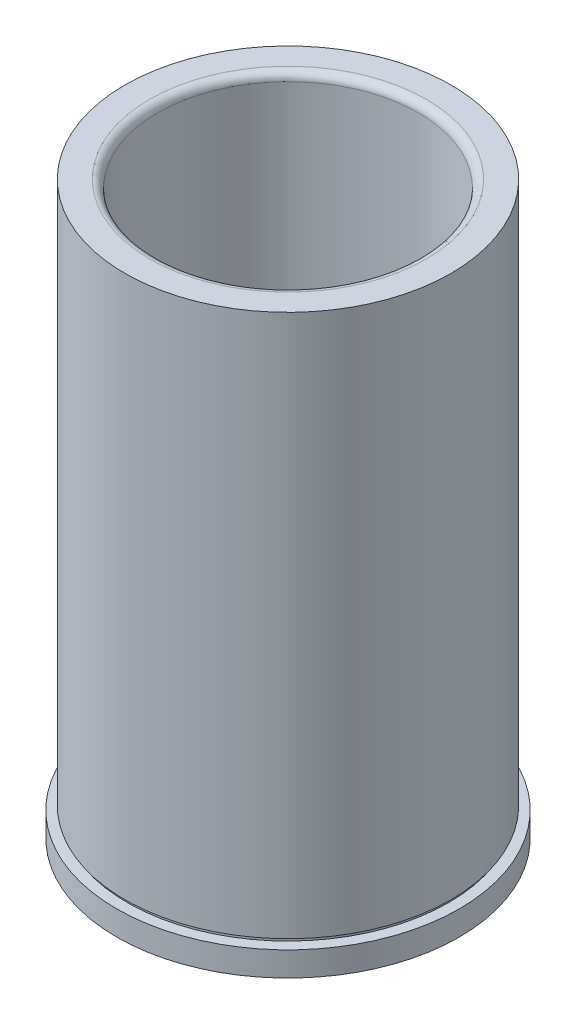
ISO-10303-21;
HEADER;
FILE_DESCRIPTION(('STEP AP214'),'2;1');
FILE_NAME('part.step','',(''),(''),'','','');
FILE_SCHEMA(('AUTOMOTIVE_DESIGN { 1 0 10303 214 1 1 1 1 }'));
ENDSEC;
DATA;
#1=APPLICATION_CONTEXT('core data for automotive mechanical design processes');
#2=APPLICATION_PROTOCOL_DEFINITION('international standard','automotive_design',2000,#1);
#3=PRODUCT_CONTEXT('',#1,'mechanical');
#4=PRODUCT('Part','Part','',(#3));
#5=PRODUCT_RELATED_PRODUCT_CATEGORY('part','',(#4));
#6=PRODUCT_DEFINITION_FORMATION('','',#4);
#7=PRODUCT_DEFINITION_CONTEXT('part definition',#1,'design');
#8=PRODUCT_DEFINITION('design','',#6,#7);
#9=PRODUCT_DEFINITION_SHAPE('','',#8);
#10=(LENGTH_UNIT() NAMED_UNIT(*) SI_UNIT(.MILLI.,.METRE.));
#11=(NAMED_UNIT(*) PLANE_ANGLE_UNIT() SI_UNIT($,.RADIAN.));
#12=(NAMED_UNIT(*) SI_UNIT($,.STERADIAN.) SOLID_ANGLE_UNIT());
#13=UNCERTAINTY_MEASURE_WITH_UNIT(LENGTH_MEASURE(1.E-05),#10,'distance_accuracy_value','');
#14=(GEOMETRIC_REPRESENTATION_CONTEXT(3) GLOBAL_UNCERTAINTY_ASSIGNED_CONTEXT((#13)) GLOBAL_UNIT_ASSIGNED_CONTEXT((#10,
#11,#12)) REPRESENTATION_CONTEXT('',''));
#15=CARTESIAN_POINT('',(0.,0.,0.));
#16=DIRECTION('',(0.,0.,1.));
#17=DIRECTION('',(1.,0.,0.));
#18=AXIS2_PLACEMENT_3D('',#15,#16,#17);
#19=CARTESIAN_POINT('',(-31.75635,111.125,0.));
#20=DIRECTION('',(0.,-1.,0.));
#21=DIRECTION('',(1.,0.,0.));
#22=AXIS2_PLACEMENT_3D('',#19,#20,#21);
#23=PLANE('',#22);
#24=CARTESIAN_POINT('',(-3.8799108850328E-13,111.125,0.));
#25=DIRECTION('',(0.,-1.,0.));
#26=DIRECTION('',(1.,0.,0.));
#27=AXIS2_PLACEMENT_3D('',#24,#25,#26);
#28=CIRCLE('',#27,26.9303499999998);
#29=CARTESIAN_POINT('',(26.9303499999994,111.125,0.));
#30=VERTEX_POINT('',#29);
#31=EDGE_CURVE('E36',#30,#30,#28,.T.);
#32=ORIENTED_EDGE('',*,*,#31,.T.);
#33=EDGE_LOOP('',(#32));
#34=FACE_BOUND('',#33,.T.);
#35=CARTESIAN_POINT('',(-3.8799108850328E-13,111.125,0.));
#36=DIRECTION('',(0.,-1.,0.));
#37=DIRECTION('',(1.,0.,0.));
#38=AXIS2_PLACEMENT_3D('',#35,#36,#37);
#39=CIRCLE('',#38,31.7563499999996);
#40=CARTESIAN_POINT('',(31.7563499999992,111.125,0.));
#41=VERTEX_POINT('',#40);
#42=EDGE_CURVE('E40',#41,#41,#39,.T.);
#43=ORIENTED_EDGE('',*,*,#42,.F.);
#44=EDGE_LOOP('',(#43));
#45=FACE_BOUND('',#44,.T.);
#46=ADVANCED_FACE('F29',(#34,#45),#23,.F.);
#47=CARTESIAN_POINT('',(3.49148336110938E-12,-1000.,0.));
#48=DIRECTION('',(0.,-1.,0.));
#49=DIRECTION('',(1.,0.,0.));
#50=AXIS2_PLACEMENT_3D('',#47,#48,#49);
#51=CYLINDRICAL_SURFACE('',#50,31.7563499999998);
#52=CARTESIAN_POINT('',(0.,5.52449999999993,0.));
#53=DIRECTION('',(0.,-1.,0.));
#54=DIRECTION('',(1.,0.,0.));
#55=AXIS2_PLACEMENT_3D('',#52,#53,#54);
#56=CIRCLE('',#55,31.75635);
#57=CARTESIAN_POINT('',(31.7563499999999,5.52450000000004,0.));
#58=VERTEX_POINT('',#57);
#59=EDGE_CURVE('E44',#58,#58,#56,.T.);
#60=ORIENTED_EDGE('',*,*,#59,.F.);
#61=EDGE_LOOP('',(#60));
#62=FACE_BOUND('',#61,.T.);
#63=ORIENTED_EDGE('',*,*,#42,.T.);
#64=EDGE_LOOP('',(#63));
#65=FACE_BOUND('',#64,.T.);
#66=ADVANCED_FACE('F121',(#62,#65),#51,.T.);
#67=CARTESIAN_POINT('',(-31.75635,5.52449999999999,0.));
#68=DIRECTION('',(0.,1.,0.));
#69=DIRECTION('',(-1.,0.,0.));
#70=AXIS2_PLACEMENT_3D('',#67,#68,#69);
#71=PLANE('',#70);
#72=CARTESIAN_POINT('',(0.,5.52449999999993,0.));
#73=DIRECTION('',(0.,-1.,0.));
#74=DIRECTION('',(1.,0.,0.));
#75=AXIS2_PLACEMENT_3D('',#72,#73,#74);
#76=CIRCLE('',#75,31.24835);
#77=CARTESIAN_POINT('',(31.2483499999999,5.52450000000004,0.));
#78=VERTEX_POINT('',#77);
#79=EDGE_CURVE('E49',#78,#78,#76,.T.);
#80=ORIENTED_EDGE('',*,*,#79,.F.);
#81=EDGE_LOOP('',(#80));
#82=FACE_BOUND('',#81,.T.);
#83=ORIENTED_EDGE('',*,*,#59,.T.);
#84=EDGE_LOOP('',(#83));
#85=FACE_BOUND('',#84,.T.);
#86=ADVANCED_FACE('F115',(#82,#85),#71,.F.);
#87=CARTESIAN_POINT('',(3.49148336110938E-12,-1000.,0.));
#88=DIRECTION('',(0.,-1.,0.));
#89=DIRECTION('',(1.,0.,0.));
#90=AXIS2_PLACEMENT_3D('',#87,#88,#89);
#91=CYLINDRICAL_SURFACE('',#90,31.24835);
#92=CARTESIAN_POINT('',(0.,4.7625,0.));
#93=DIRECTION('',(0.,-1.,0.));
#94=DIRECTION('',(1.,0.,0.));
#95=AXIS2_PLACEMENT_3D('',#92,#93,#94);
#96=CIRCLE('',#95,31.24835);
#97=CARTESIAN_POINT('',(31.24835,4.76250000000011,0.));
#98=VERTEX_POINT('',#97);
#99=EDGE_CURVE('E52',#98,#98,#96,.T.);
#100=ORIENTED_EDGE('',*,*,#99,.F.);
#101=EDGE_LOOP('',(#100));
#102=FACE_BOUND('',#101,.T.);
#103=ORIENTED_EDGE('',*,*,#79,.T.);
#104=EDGE_LOOP('',(#103));
#105=FACE_BOUND('',#104,.T.);
#106=ADVANCED_FACE('F109',(#102,#105),#91,.T.);
#107=CARTESIAN_POINT('',(-33.3375,4.76249999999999,0.));
#108=DIRECTION('',(0.,-1.,0.));
#109=DIRECTION('',(1.,0.,0.));
#110=AXIS2_PLACEMENT_3D('',#107,#108,#109);
#111=PLANE('',#110);
#112=CARTESIAN_POINT('',(0.,4.76250000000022,0.));
#113=DIRECTION('',(0.,-1.,0.));
#114=DIRECTION('',(1.,0.,0.));
#115=AXIS2_PLACEMENT_3D('',#112,#113,#114);
#116=CIRCLE('',#115,33.3375);
#117=CARTESIAN_POINT('',(33.3375,4.76250000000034,0.));
#118=VERTEX_POINT('',#117);
#119=EDGE_CURVE('E55',#118,#118,#116,.T.);
#120=ORIENTED_EDGE('',*,*,#119,.F.);
#121=EDGE_LOOP('',(#120));
#122=FACE_BOUND('',#121,.T.);
#123=ORIENTED_EDGE('',*,*,#99,.T.);
#124=EDGE_LOOP('',(#123));
#125=FACE_BOUND('',#124,.T.);
#126=ADVANCED_FACE('F103',(#122,#125),#111,.F.);
#127=CARTESIAN_POINT('',(3.49148336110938E-12,-1000.,0.));
#128=DIRECTION('',(0.,-1.,0.));
#129=DIRECTION('',(1.,0.,0.));
#130=AXIS2_PLACEMENT_3D('',#127,#128,#129);
#131=CYLINDRICAL_SURFACE('',#130,33.3375);
#132=CARTESIAN_POINT('',(0.,2.22044604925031E-13,0.));
#133=DIRECTION('',(0.,-1.,0.));
#134=DIRECTION('',(1.,0.,0.));
#135=AXIS2_PLACEMENT_3D('',#132,#133,#134);
#136=CIRCLE('',#135,33.3375);
#137=CARTESIAN_POINT('',(33.3375,3.38441931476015E-13,0.));
#138=VERTEX_POINT('',#137);
#139=EDGE_CURVE('E58',#138,#138,#136,.T.);
#140=ORIENTED_EDGE('',*,*,#139,.F.);
#141=EDGE_LOOP('',(#140));
#142=FACE_BOUND('',#141,.T.);
#143=ORIENTED_EDGE('',*,*,#119,.T.);
#144=EDGE_LOOP('',(#143));
#145=FACE_BOUND('',#144,.T.);
#146=ADVANCED_FACE('F97',(#142,#145),#131,.T.);
#147=CARTESIAN_POINT('',(-27.4701,0.,0.));
#148=DIRECTION('',(0.,1.,0.));
#149=DIRECTION('',(-1.,0.,0.));
#150=AXIS2_PLACEMENT_3D('',#147,#148,#149);
#151=PLANE('',#150);
#152=CARTESIAN_POINT('',(0.,0.,0.));
#153=DIRECTION('',(0.,-1.,0.));
#154=DIRECTION('',(1.,0.,0.));
#155=AXIS2_PLACEMENT_3D('',#152,#153,#154);
#156=CIRCLE('',#155,27.4701);
#157=CARTESIAN_POINT('',(27.4701,0.,0.));
#158=VERTEX_POINT('',#157);
#159=EDGE_CURVE('E61',#158,#158,#156,.T.);
#160=ORIENTED_EDGE('',*,*,#159,.F.);
#161=EDGE_LOOP('',(#160));
#162=FACE_BOUND('',#161,.T.);
#163=ORIENTED_EDGE('',*,*,#139,.T.);
#164=EDGE_LOOP('',(#163));
#165=FACE_BOUND('',#164,.T.);
#166=ADVANCED_FACE('F91',(#162,#165),#151,.F.);
#167=CARTESIAN_POINT('',(0.,0.,0.));
#168=DIRECTION('',(0.,-1.,0.));
#169=DIRECTION('',(1.,0.,0.));
#170=AXIS2_PLACEMENT_3D('',#167,#168,#169);
#171=CONICAL_SURFACE('',#170,27.4701,0.785398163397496);
#172=CARTESIAN_POINT('',(0.,0.793749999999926,0.));
#173=DIRECTION('',(0.,-1.,0.));
#174=DIRECTION('',(1.,0.,0.));
#175=AXIS2_PLACEMENT_3D('',#172,#173,#174);
#176=CIRCLE('',#175,26.67635);
#177=CARTESIAN_POINT('',(26.67635,0.79375000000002,0.));
#178=VERTEX_POINT('',#177);
#179=EDGE_CURVE('E64',#178,#178,#176,.T.);
#180=ORIENTED_EDGE('',*,*,#179,.F.);
#181=EDGE_LOOP('',(#180));
#182=FACE_BOUND('',#181,.T.);
#183=ORIENTED_EDGE('',*,*,#159,.T.);
#184=EDGE_LOOP('',(#183));
#185=FACE_BOUND('',#184,.T.);
#186=ADVANCED_FACE('F85',(#182,#185),#171,.F.);
#187=CARTESIAN_POINT('',(3.49148336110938E-12,-1000.,0.));
#188=DIRECTION('',(0.,-1.,0.));
#189=DIRECTION('',(1.,0.,0.));
#190=AXIS2_PLACEMENT_3D('',#187,#188,#189);
#191=CYLINDRICAL_SURFACE('',#190,26.67635);
#192=CARTESIAN_POINT('',(0.,8.2549999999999,0.));
#193=DIRECTION('',(0.,-1.,0.));
#194=DIRECTION('',(1.,0.,0.));
#195=AXIS2_PLACEMENT_3D('',#192,#193,#194);
#196=CIRCLE('',#195,26.67635);
#197=CARTESIAN_POINT('',(26.6763499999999,8.255,0.));
#198=VERTEX_POINT('',#197);
#199=EDGE_CURVE('E67',#198,#198,#196,.T.);
#200=ORIENTED_EDGE('',*,*,#199,.F.);
#201=EDGE_LOOP('',(#200));
#202=FACE_BOUND('',#201,.T.);
#203=ORIENTED_EDGE('',*,*,#179,.T.);
#204=EDGE_LOOP('',(#203));
#205=FACE_BOUND('',#204,.T.);
#206=ADVANCED_FACE('F79',(#202,#205),#191,.F.);
#207=CARTESIAN_POINT('',(0.,8.255,0.));
#208=DIRECTION('',(0.,-1.,0.));
#209=DIRECTION('',(1.,0.,0.));
#210=AXIS2_PLACEMENT_3D('',#207,#208,#209);
#211=TOROIDAL_SURFACE('',#210,25.40635,1.27);
#212=CARTESIAN_POINT('',(0.,9.52500000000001,0.));
#213=DIRECTION('',(0.,-1.,0.));
#214=DIRECTION('',(1.,0.,0.));
#215=AXIS2_PLACEMENT_3D('',#212,#213,#214);
#216=CIRCLE('',#215,25.40635);
#217=CARTESIAN_POINT('',(25.4063499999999,9.52500000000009,0.));
#218=VERTEX_POINT('',#217);
#219=EDGE_CURVE('E70',#218,#218,#216,.T.);
#220=ORIENTED_EDGE('',*,*,#219,.F.);
#221=EDGE_LOOP('',(#220));
#222=FACE_BOUND('',#221,.T.);
#223=ORIENTED_EDGE('',*,*,#199,.T.);
#224=EDGE_LOOP('',(#223));
#225=FACE_BOUND('',#224,.T.);
#226=ADVANCED_FACE('F76',(#222,#225),#211,.F.);
#227=CARTESIAN_POINT('',(3.49148336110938E-12,-1000.,0.));
#228=DIRECTION('',(0.,-1.,0.));
#229=DIRECTION('',(1.,0.,0.));
#230=AXIS2_PLACEMENT_3D('',#227,#228,#229);
#231=CYLINDRICAL_SURFACE('',#230,25.4063499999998);
#232=CARTESIAN_POINT('',(-3.8267006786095E-13,109.601,0.));
#233=DIRECTION('',(0.,-1.,0.));
#234=DIRECTION('',(1.,0.,0.));
#235=AXIS2_PLACEMENT_3D('',#232,#233,#234);
#236=CIRCLE('',#235,25.4063499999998);
#237=CARTESIAN_POINT('',(25.4063499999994,109.601,0.));
#238=VERTEX_POINT('',#237);
#239=EDGE_CURVE('E10',#238,#238,#236,.F.);
#240=ORIENTED_EDGE('',*,*,#239,.T.);
#241=EDGE_LOOP('',(#240));
#242=FACE_BOUND('',#241,.T.);
#243=ORIENTED_EDGE('',*,*,#219,.T.);
#244=EDGE_LOOP('',(#243));
#245=FACE_BOUND('',#244,.T.);
#246=ADVANCED_FACE('F74',(#242,#245),#231,.F.);
#247=CARTESIAN_POINT('',(-3.8267006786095E-13,109.601,0.));
#248=DIRECTION('',(0.,-1.,0.));
#249=DIRECTION('',(1.,0.,0.));
#250=AXIS2_PLACEMENT_3D('',#247,#248,#249);
#251=TOROIDAL_SURFACE('',#250,26.9303499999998,1.524);
#252=ORIENTED_EDGE('',*,*,#239,.F.);
#253=EDGE_LOOP('',(#252));
#254=FACE_BOUND('',#253,.T.);
#255=ORIENTED_EDGE('',*,*,#31,.F.);
#256=EDGE_LOOP('',(#255));
#257=FACE_BOUND('',#256,.T.);
#258=ADVANCED_FACE('F31',(#254,#257),#251,.T.);
#259=CLOSED_SHELL('',(#46,#66,#86,#106,#126,#146,#166,#186,#206,#226,#246,#258));
#260=MANIFOLD_SOLID_BREP('B2',#259);
#261=ADVANCED_BREP_SHAPE_REPRESENTATION('',(#18,#260),#14);
#262=SHAPE_DEFINITION_REPRESENTATION(#9,#261);
ENDSEC;
END-ISO-10303-21;
